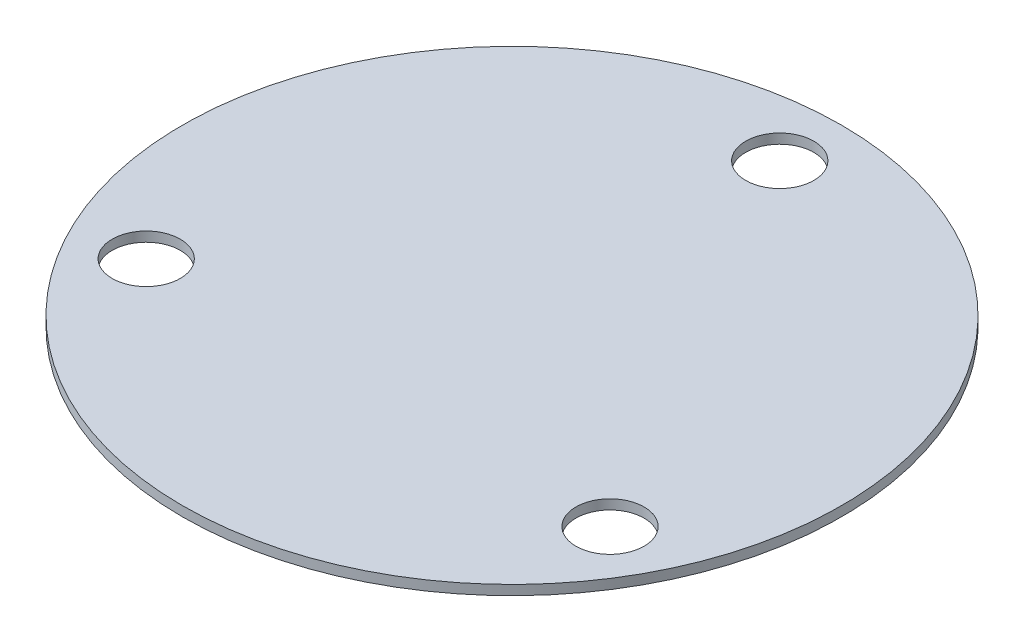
ISO-10303-21;
HEADER;
FILE_DESCRIPTION(('STEP AP214'),'2;1');
FILE_NAME('part.step','',(''),(''),'','','');
FILE_SCHEMA(('AUTOMOTIVE_DESIGN { 1 0 10303 214 1 1 1 1 }'));
ENDSEC;
DATA;
#1=APPLICATION_CONTEXT('core data for automotive mechanical design processes');
#2=APPLICATION_PROTOCOL_DEFINITION('international standard','automotive_design',2000,#1);
#3=PRODUCT_CONTEXT('',#1,'mechanical');
#4=PRODUCT('Part','Part','',(#3));
#5=PRODUCT_RELATED_PRODUCT_CATEGORY('part','',(#4));
#6=PRODUCT_DEFINITION_FORMATION('','',#4);
#7=PRODUCT_DEFINITION_CONTEXT('part definition',#1,'design');
#8=PRODUCT_DEFINITION('design','',#6,#7);
#9=PRODUCT_DEFINITION_SHAPE('','',#8);
#10=(LENGTH_UNIT() NAMED_UNIT(*) SI_UNIT(.MILLI.,.METRE.));
#11=(NAMED_UNIT(*) PLANE_ANGLE_UNIT() SI_UNIT($,.RADIAN.));
#12=(NAMED_UNIT(*) SI_UNIT($,.STERADIAN.) SOLID_ANGLE_UNIT());
#13=UNCERTAINTY_MEASURE_WITH_UNIT(LENGTH_MEASURE(1.E-05),#10,'distance_accuracy_value','');
#14=(GEOMETRIC_REPRESENTATION_CONTEXT(3) GLOBAL_UNCERTAINTY_ASSIGNED_CONTEXT((#13)) GLOBAL_UNIT_ASSIGNED_CONTEXT((#10,
#11,#12)) REPRESENTATION_CONTEXT('',''));
#15=CARTESIAN_POINT('',(0.,0.,0.));
#16=DIRECTION('',(0.,0.,1.));
#17=DIRECTION('',(1.,0.,0.));
#18=AXIS2_PLACEMENT_3D('',#15,#16,#17);
#19=CARTESIAN_POINT('',(0.,3.,0.));
#20=DIRECTION('',(0.,-1.,0.));
#21=DIRECTION('',(0.,0.,-1.));
#22=AXIS2_PLACEMENT_3D('',#19,#20,#21);
#23=CYLINDRICAL_SURFACE('',#22,101.6);
#24=CARTESIAN_POINT('',(0.,3.,0.));
#25=DIRECTION('',(0.,1.,0.));
#26=DIRECTION('',(0.,0.,1.));
#27=AXIS2_PLACEMENT_3D('',#24,#25,#26);
#28=CIRCLE('',#27,101.6);
#29=CARTESIAN_POINT('',(0.,3.,101.6));
#30=VERTEX_POINT('',#29);
#31=EDGE_CURVE('E10',#30,#30,#28,.T.);
#32=ORIENTED_EDGE('',*,*,#31,.F.);
#33=EDGE_LOOP('',(#32));
#34=FACE_BOUND('',#33,.T.);
#35=CARTESIAN_POINT('',(0.,0.,0.));
#36=DIRECTION('',(0.,1.,0.));
#37=DIRECTION('',(0.,0.,1.));
#38=AXIS2_PLACEMENT_3D('',#35,#36,#37);
#39=CIRCLE('',#38,101.6);
#40=CARTESIAN_POINT('',(0.,0.,101.6));
#41=VERTEX_POINT('',#40);
#42=EDGE_CURVE('E51',#41,#41,#39,.T.);
#43=ORIENTED_EDGE('',*,*,#42,.T.);
#44=EDGE_LOOP('',(#43));
#45=FACE_BOUND('',#44,.T.);
#46=ADVANCED_FACE('F43',(#34,#45),#23,.T.);
#47=CARTESIAN_POINT('',(0.,3.,0.));
#48=DIRECTION('',(0.,1.,0.));
#49=DIRECTION('',(0.,0.,1.));
#50=AXIS2_PLACEMENT_3D('',#47,#48,#49);
#51=PLANE('',#50);
#52=CARTESIAN_POINT('',(0.,3.,-82.55));
#53=DIRECTION('',(0.,1.,0.));
#54=DIRECTION('',(0.,0.,1.));
#55=AXIS2_PLACEMENT_3D('',#52,#53,#54);
#56=CIRCLE('',#55,10.5);
#57=CARTESIAN_POINT('',(0.,3.,-72.05));
#58=VERTEX_POINT('',#57);
#59=EDGE_CURVE('E66',#58,#58,#56,.T.);
#60=ORIENTED_EDGE('',*,*,#59,.F.);
#61=EDGE_LOOP('',(#60));
#62=FACE_BOUND('',#61,.T.);
#63=CARTESIAN_POINT('',(-71.4903970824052,3.,41.2750000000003));
#64=DIRECTION('',(0.,1.,0.));
#65=DIRECTION('',(0.,0.,1.));
#66=AXIS2_PLACEMENT_3D('',#63,#64,#65);
#67=CIRCLE('',#66,10.5);
#68=CARTESIAN_POINT('',(-71.4903970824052,3.,51.7750000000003));
#69=VERTEX_POINT('',#68);
#70=EDGE_CURVE('E115',#69,#69,#67,.T.);
#71=ORIENTED_EDGE('',*,*,#70,.F.);
#72=EDGE_LOOP('',(#71));
#73=FACE_BOUND('',#72,.T.);
#74=CARTESIAN_POINT('',(71.4903970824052,3.,41.2750000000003));
#75=DIRECTION('',(0.,1.,0.));
#76=DIRECTION('',(0.,0.,1.));
#77=AXIS2_PLACEMENT_3D('',#74,#75,#76);
#78=CIRCLE('',#77,10.5);
#79=CARTESIAN_POINT('',(71.4903970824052,3.,51.7750000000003));
#80=VERTEX_POINT('',#79);
#81=EDGE_CURVE('E59',#80,#80,#78,.T.);
#82=ORIENTED_EDGE('',*,*,#81,.F.);
#83=EDGE_LOOP('',(#82));
#84=FACE_BOUND('',#83,.T.);
#85=ORIENTED_EDGE('',*,*,#31,.T.);
#86=EDGE_LOOP('',(#85));
#87=FACE_BOUND('',#86,.T.);
#88=ADVANCED_FACE('F90',(#62,#73,#84,#87),#51,.T.);
#89=CARTESIAN_POINT('',(0.,0.,0.));
#90=DIRECTION('',(0.,1.,0.));
#91=DIRECTION('',(0.,0.,1.));
#92=AXIS2_PLACEMENT_3D('',#89,#90,#91);
#93=PLANE('',#92);
#94=CARTESIAN_POINT('',(0.,0.,-82.55));
#95=DIRECTION('',(0.,1.,0.));
#96=DIRECTION('',(0.,0.,1.));
#97=AXIS2_PLACEMENT_3D('',#94,#95,#96);
#98=CIRCLE('',#97,10.5);
#99=CARTESIAN_POINT('',(0.,0.,-72.05));
#100=VERTEX_POINT('',#99);
#101=EDGE_CURVE('E46',#100,#100,#98,.T.);
#102=ORIENTED_EDGE('',*,*,#101,.T.);
#103=EDGE_LOOP('',(#102));
#104=FACE_BOUND('',#103,.T.);
#105=CARTESIAN_POINT('',(-71.4903970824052,0.,41.2750000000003));
#106=DIRECTION('',(0.,1.,0.));
#107=DIRECTION('',(0.,0.,1.));
#108=AXIS2_PLACEMENT_3D('',#105,#106,#107);
#109=CIRCLE('',#108,10.5);
#110=CARTESIAN_POINT('',(-71.4903970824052,0.,51.7750000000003));
#111=VERTEX_POINT('',#110);
#112=EDGE_CURVE('E65',#111,#111,#109,.T.);
#113=ORIENTED_EDGE('',*,*,#112,.T.);
#114=EDGE_LOOP('',(#113));
#115=FACE_BOUND('',#114,.T.);
#116=CARTESIAN_POINT('',(71.4903970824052,0.,41.2750000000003));
#117=DIRECTION('',(0.,1.,0.));
#118=DIRECTION('',(0.,0.,1.));
#119=AXIS2_PLACEMENT_3D('',#116,#117,#118);
#120=CIRCLE('',#119,10.5);
#121=CARTESIAN_POINT('',(71.4903970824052,0.,51.7750000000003));
#122=VERTEX_POINT('',#121);
#123=EDGE_CURVE('E62',#122,#122,#120,.T.);
#124=ORIENTED_EDGE('',*,*,#123,.T.);
#125=EDGE_LOOP('',(#124));
#126=FACE_BOUND('',#125,.T.);
#127=ORIENTED_EDGE('',*,*,#42,.F.);
#128=EDGE_LOOP('',(#127));
#129=FACE_BOUND('',#128,.T.);
#130=ADVANCED_FACE('F75',(#104,#115,#126,#129),#93,.F.);
#131=CARTESIAN_POINT('',(71.4903970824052,-7.,41.2750000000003));
#132=DIRECTION('',(0.,1.,0.));
#133=DIRECTION('',(0.,0.,1.));
#134=AXIS2_PLACEMENT_3D('',#131,#132,#133);
#135=CYLINDRICAL_SURFACE('',#134,10.5);
#136=ORIENTED_EDGE('',*,*,#81,.T.);
#137=EDGE_LOOP('',(#136));
#138=FACE_BOUND('',#137,.T.);
#139=ORIENTED_EDGE('',*,*,#123,.F.);
#140=EDGE_LOOP('',(#139));
#141=FACE_BOUND('',#140,.T.);
#142=ADVANCED_FACE('F85',(#138,#141),#135,.F.);
#143=CARTESIAN_POINT('',(-71.4903970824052,-7.,41.2750000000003));
#144=DIRECTION('',(0.,1.,0.));
#145=DIRECTION('',(0.,0.,1.));
#146=AXIS2_PLACEMENT_3D('',#143,#144,#145);
#147=CYLINDRICAL_SURFACE('',#146,10.5);
#148=ORIENTED_EDGE('',*,*,#70,.T.);
#149=EDGE_LOOP('',(#148));
#150=FACE_BOUND('',#149,.T.);
#151=ORIENTED_EDGE('',*,*,#112,.F.);
#152=EDGE_LOOP('',(#151));
#153=FACE_BOUND('',#152,.T.);
#154=ADVANCED_FACE('F79',(#150,#153),#147,.F.);
#155=CARTESIAN_POINT('',(0.,-7.,-82.55));
#156=DIRECTION('',(0.,1.,0.));
#157=DIRECTION('',(0.,0.,1.));
#158=AXIS2_PLACEMENT_3D('',#155,#156,#157);
#159=CYLINDRICAL_SURFACE('',#158,10.5);
#160=ORIENTED_EDGE('',*,*,#59,.T.);
#161=EDGE_LOOP('',(#160));
#162=FACE_BOUND('',#161,.T.);
#163=ORIENTED_EDGE('',*,*,#101,.F.);
#164=EDGE_LOOP('',(#163));
#165=FACE_BOUND('',#164,.T.);
#166=ADVANCED_FACE('F77',(#162,#165),#159,.F.);
#167=CLOSED_SHELL('',(#46,#88,#130,#142,#154,#166));
#168=MANIFOLD_SOLID_BREP('B2',#167);
#169=ADVANCED_BREP_SHAPE_REPRESENTATION('',(#18,#168),#14);
#170=SHAPE_DEFINITION_REPRESENTATION(#9,#169);
ENDSEC;
END-ISO-10303-21;
